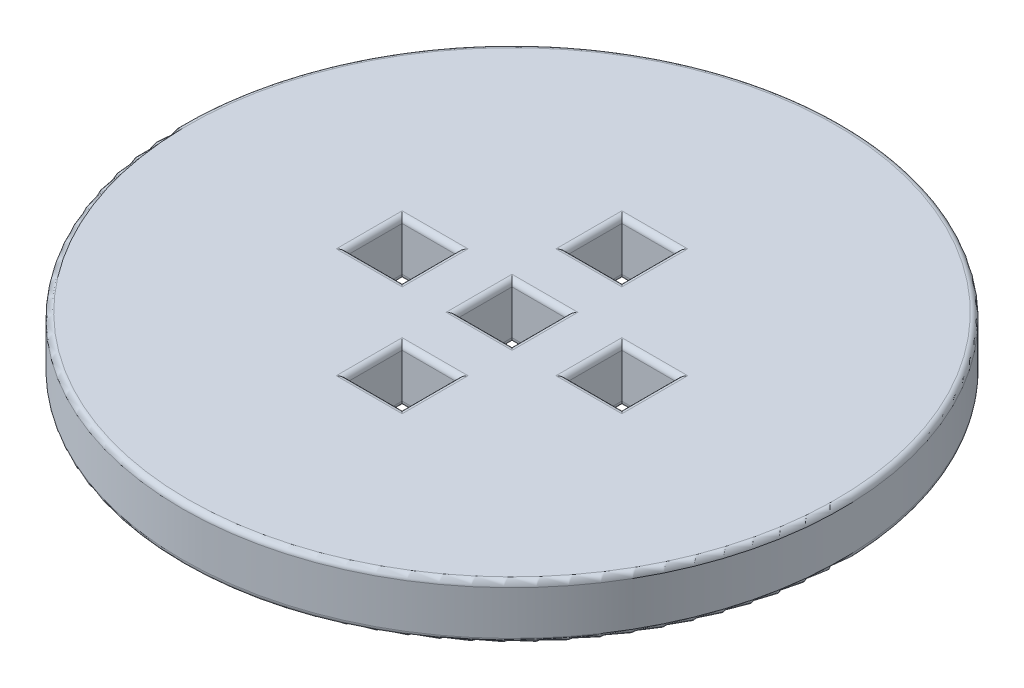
from build123d import *

# Parameters (mm, degrees)
SKETCH1_R           = 30
BOSS_EXTRUDE1_DEPTH = 5
SKETCH2_W           = 5
SKETCH2_H           = 5
CUT_EXTRUDE1_DEPTH  = 2.5
FILLET1_R           = 0.5
SKETCH4_W           = 5
SKETCH4_H           = 5
CUT_EXTRUDE2_DEPTH  = 2.5
FILLET2_R           = 0.5
FILLET3_R           = 0.5


with BuildPart() as part:
    # Sketch1 → Boss-Extrude1 (new body)
    with BuildSketch(Plane(origin=(0, 0, 0), x_dir=(1, 0, 0), z_dir=(0, 1, 0))):
        with Locations(Location((0, 0, 0), (0, 0, 270))):
            Circle(SKETCH1_R)
    extrude(amount=BOSS_EXTRUDE1_DEPTH)

    # Sketch2 → Cut-Extrude1 (cut)
    with BuildSketch(Plane(origin=(0, 5, 0), x_dir=(1, 0, 0), z_dir=(0, 1, 0))):
        with Locations((0, -10)):
            Rectangle(SKETCH2_W, SKETCH2_H)
        with Locations((-10, 0)):
            Rectangle(SKETCH2_W, SKETCH2_H)
        Rectangle(SKETCH2_W, SKETCH2_H)
        with Locations((0, 10)):
            Rectangle(SKETCH2_W, SKETCH2_H)
        with Locations((10, 0)):
            Rectangle(SKETCH2_W, SKETCH2_H)
    extrude(amount=-CUT_EXTRUDE1_DEPTH, mode=Mode.SUBTRACT)

    # Fillet1
    fillet1_edges = [part.edges().sort_by_distance(p)[0] for p in [
        (2.5, 5, 0),
        (0, 5, 2.5),
        (-12.5, 5, 0),
        (-10, 5, 2.5),
        (-7.5, 5, 0),
        (-10, 5, -2.5),
    ]]
    fillet(fillet1_edges, radius=FILLET1_R)

    # Sketch4 → Cut-Extrude2 (cut)
    with BuildSketch(Plane(origin=(0, 0, 0), x_dir=(-1, 0, 0), z_dir=(0, -1, 0))):
        Rectangle(SKETCH4_W, SKETCH4_H)
        with Locations((0, -10)):
            Rectangle(SKETCH4_W, SKETCH4_H)
        with Locations((10, 0)):
            Rectangle(SKETCH4_W, SKETCH4_H)
        with Locations((-10, 0)):
            Rectangle(SKETCH4_W, SKETCH4_H)
        with Locations((0, 10)):
            Rectangle(SKETCH4_W, SKETCH4_H)
    extrude(amount=-CUT_EXTRUDE2_DEPTH, mode=Mode.SUBTRACT)

    # Fillet2
    fillet2_edges = [part.edges().sort_by_distance(p)[0] for p in [
        (-2.5, 0, 0),
        (0, 0, -2.5),
        (2.5, 0, 0),
        (0, 0, 2.5),
        (-2.5, 0, 10),
        (0, 0, 7.5),
        (2.5, 0, 10),
        (0, 0, 12.5),
        (-12.5, 0, 0),
        (-10, 0, -2.5),
        (-7.5, 0, 0),
        (-10, 0, 2.5),
        (7.5, 0, 0),
        (10, 0, -2.5),
        (12.5, 0, 0),
        (10, 0, 2.5),
        (2.5, 0, -10),
        (0, 0, -7.5),
        (-2.5, 0, -10),
        (0, 0, -12.5),
        (0, 0, -30),
    ]]
    fillet(fillet2_edges, radius=FILLET2_R)

    # Fillet3
    fillet3_edges = [part.edges().sort_by_distance(p)[0] for p in [
        (0, 5, -30),
        (0, 5, 7.5),
        (-2.5, 5, 10),
        (0, 5, 12.5),
        (2.5, 5, 10),
        (-2.5, 5, 0.25),
        (0.25, 5, -2.5),
        (0, 5, -12.5),
        (-2.5, 5, -10),
        (0, 5, -7.5),
        (2.5, 5, -10),
        (10, 5, 2.5),
        (12.5, 5, 0),
        (10, 5, -2.5),
        (7.5, 5, 0),
    ]]
    fillet(fillet3_edges, radius=FILLET3_R)


solid = part.part
